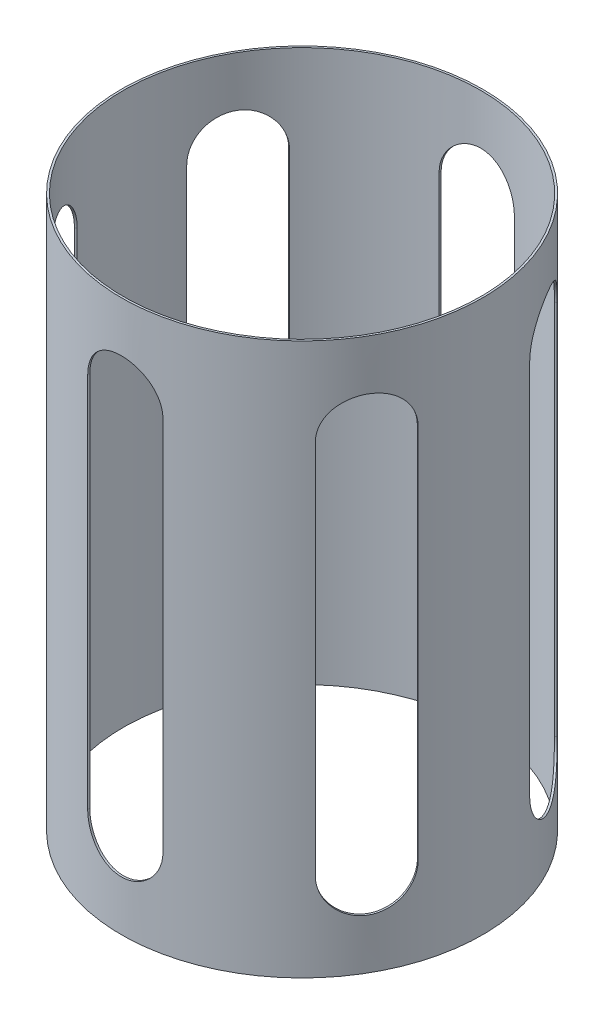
from build123d import *

# Parameters (mm, degrees)
SKETCH1_W          = 1.02362
SKETCH1_H          = 279.4
CUT_EXTRUDE1_DEPTH = 308.917083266
CIRPATTERN1_COUNT  = 6


with BuildPart() as part:
    # Sketch1 → Revolve1 (revolve)
    with BuildSketch(Plane.XY, mode=Mode.PRIVATE) as revolve1_sk:
        with Locations((-90.99931, 139.7)):
            Rectangle(SKETCH1_W, SKETCH1_H)
    revolve(revolve1_sk.sketch.rotate(Axis((0, 0, 0), (0, 1, 0)), 270), axis=Axis((0, 0, 0), (0, 1, 0)))

    # Sketch2 → Cut-Extrude1 (cut, through all)
    with BuildSketch(Plane.XY):
        with BuildLine():
            Line((19.05, 234.95), (19.05, 44.45))
            ThreePointArc((19.05, 44.45), (0, 25.4), (-19.05, 44.45))
            Line((-19.05, 44.45), (-19.05, 234.95))
            ThreePointArc((-19.05, 234.95), (0, 254), (19.05, 234.95))
        make_face()
    cut_extrude1 = extrude(amount=-CUT_EXTRUDE1_DEPTH, mode=Mode.SUBTRACT)

    # CirPattern1: Cut-Extrude1 ×6 about axis
    cirpattern1_axis = Axis((0, 0, 0), (0, 1, 0))
    for i in range(1, CIRPATTERN1_COUNT):
        add(cut_extrude1.rotate(cirpattern1_axis, i * 360 / CIRPATTERN1_COUNT), mode=Mode.SUBTRACT)


solid = part.part
